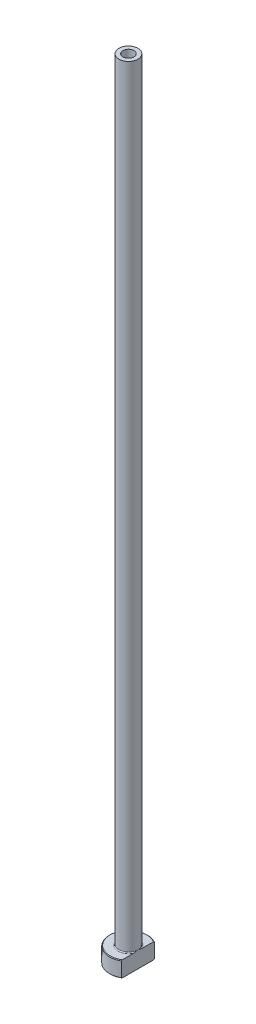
ISO-10303-21;
HEADER;
FILE_DESCRIPTION(('STEP AP214'),'2;1');
FILE_NAME('part.step','',(''),(''),'','','');
FILE_SCHEMA(('AUTOMOTIVE_DESIGN { 1 0 10303 214 1 1 1 1 }'));
ENDSEC;
DATA;
#1=APPLICATION_CONTEXT('core data for automotive mechanical design processes');
#2=APPLICATION_PROTOCOL_DEFINITION('international standard','automotive_design',2000,#1);
#3=PRODUCT_CONTEXT('',#1,'mechanical');
#4=PRODUCT('Part','Part','',(#3));
#5=PRODUCT_RELATED_PRODUCT_CATEGORY('part','',(#4));
#6=PRODUCT_DEFINITION_FORMATION('','',#4);
#7=PRODUCT_DEFINITION_CONTEXT('part definition',#1,'design');
#8=PRODUCT_DEFINITION('design','',#6,#7);
#9=PRODUCT_DEFINITION_SHAPE('','',#8);
#10=(LENGTH_UNIT() NAMED_UNIT(*) SI_UNIT(.MILLI.,.METRE.));
#11=(NAMED_UNIT(*) PLANE_ANGLE_UNIT() SI_UNIT($,.RADIAN.));
#12=(NAMED_UNIT(*) SI_UNIT($,.STERADIAN.) SOLID_ANGLE_UNIT());
#13=UNCERTAINTY_MEASURE_WITH_UNIT(LENGTH_MEASURE(1.E-05),#10,'distance_accuracy_value','');
#14=(GEOMETRIC_REPRESENTATION_CONTEXT(3) GLOBAL_UNCERTAINTY_ASSIGNED_CONTEXT((#13)) GLOBAL_UNIT_ASSIGNED_CONTEXT((#10,
#11,#12)) REPRESENTATION_CONTEXT('',''));
#15=CARTESIAN_POINT('',(0.,0.,0.));
#16=DIRECTION('',(0.,0.,1.));
#17=DIRECTION('',(1.,0.,0.));
#18=AXIS2_PLACEMENT_3D('',#15,#16,#17);
#19=CARTESIAN_POINT('',(0.,92.1876809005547,0.));
#20=DIRECTION('',(0.,1.,0.));
#21=DIRECTION('',(0.,0.,1.));
#22=AXIS2_PLACEMENT_3D('',#19,#20,#21);
#23=CYLINDRICAL_SURFACE('',#22,1.75000000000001);
#24=CARTESIAN_POINT('',(0.,250.,0.));
#25=DIRECTION('',(0.,1.,0.));
#26=DIRECTION('',(0.,0.,1.));
#27=AXIS2_PLACEMENT_3D('',#24,#25,#26);
#28=CIRCLE('',#27,1.75000000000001);
#29=CARTESIAN_POINT('',(0.,250.,1.75000000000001));
#30=VERTEX_POINT('',#29);
#31=EDGE_CURVE('E167',#30,#30,#28,.T.);
#32=ORIENTED_EDGE('',*,*,#31,.T.);
#33=EDGE_LOOP('',(#32));
#34=FACE_BOUND('',#33,.T.);
#35=CARTESIAN_POINT('',(0.,205.,0.));
#36=DIRECTION('',(0.,1.,0.));
#37=DIRECTION('',(0.,0.,1.));
#38=AXIS2_PLACEMENT_3D('',#35,#36,#37);
#39=CIRCLE('',#38,1.75000000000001);
#40=CARTESIAN_POINT('',(0.,205.,1.75000000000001));
#41=VERTEX_POINT('',#40);
#42=EDGE_CURVE('E170',#41,#41,#39,.T.);
#43=ORIENTED_EDGE('',*,*,#42,.F.);
#44=EDGE_LOOP('',(#43));
#45=FACE_BOUND('',#44,.T.);
#46=ADVANCED_FACE('F32',(#34,#45),#23,.F.);
#47=CARTESIAN_POINT('',(-1.75000000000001,250.,0.));
#48=DIRECTION('',(0.,1.,0.));
#49=DIRECTION('',(0.,0.,1.));
#50=AXIS2_PLACEMENT_3D('',#47,#48,#49);
#51=PLANE('',#50);
#52=CARTESIAN_POINT('',(0.,250.,0.));
#53=DIRECTION('',(0.,1.,0.));
#54=DIRECTION('',(0.,0.,1.));
#55=AXIS2_PLACEMENT_3D('',#52,#53,#54);
#56=CIRCLE('',#55,3.00000000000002);
#57=CARTESIAN_POINT('',(0.,250.,3.00000000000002));
#58=VERTEX_POINT('',#57);
#59=EDGE_CURVE('E174',#58,#58,#56,.T.);
#60=ORIENTED_EDGE('',*,*,#59,.T.);
#61=EDGE_LOOP('',(#60));
#62=FACE_BOUND('',#61,.T.);
#63=ORIENTED_EDGE('',*,*,#31,.F.);
#64=EDGE_LOOP('',(#63));
#65=FACE_BOUND('',#64,.T.);
#66=ADVANCED_FACE('F157',(#62,#65),#51,.T.);
#67=CARTESIAN_POINT('',(0.,92.1876809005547,0.));
#68=DIRECTION('',(0.,1.,0.));
#69=DIRECTION('',(0.,0.,1.));
#70=AXIS2_PLACEMENT_3D('',#67,#68,#69);
#71=CYLINDRICAL_SURFACE('',#70,3.);
#72=CARTESIAN_POINT('',(0.,5.3,0.));
#73=DIRECTION('',(0.,1.,0.));
#74=DIRECTION('',(0.,0.,1.));
#75=AXIS2_PLACEMENT_3D('',#72,#73,#74);
#76=CIRCLE('',#75,3.);
#77=CARTESIAN_POINT('',(3.,5.3,0.));
#78=VERTEX_POINT('',#77);
#79=EDGE_CURVE('E180',#78,#78,#76,.T.);
#80=ORIENTED_EDGE('',*,*,#79,.T.);
#81=EDGE_LOOP('',(#80));
#82=FACE_BOUND('',#81,.T.);
#83=ORIENTED_EDGE('',*,*,#59,.F.);
#84=EDGE_LOOP('',(#83));
#85=FACE_BOUND('',#84,.T.);
#86=ADVANCED_FACE('F162',(#82,#85),#71,.T.);
#87=CARTESIAN_POINT('',(-2.99999999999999,5.,0.));
#88=DIRECTION('',(0.,1.,0.));
#89=DIRECTION('',(0.,0.,1.));
#90=AXIS2_PLACEMENT_3D('',#87,#88,#89);
#91=PLANE('',#90);
#92=DIRECTION('',(0.,0.,1.));
#93=VECTOR('',#92,1.);
#94=CARTESIAN_POINT('',(3.,5.,0.));
#95=LINE('',#94,#93);
#96=CARTESIAN_POINT('',(3.,5.,-4.96386945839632));
#97=VERTEX_POINT('',#96);
#98=CARTESIAN_POINT('',(3.,5.,-1.37477270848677));
#99=VERTEX_POINT('',#98);
#100=EDGE_CURVE('E54',#97,#99,#95,.T.);
#101=ORIENTED_EDGE('',*,*,#100,.F.);
#102=CARTESIAN_POINT('',(0.,5.,0.));
#103=DIRECTION('',(0.,1.,0.));
#104=DIRECTION('',(0.,0.,1.));
#105=AXIS2_PLACEMENT_3D('',#102,#103,#104);
#106=CIRCLE('',#105,5.79999999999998);
#107=CARTESIAN_POINT('',(2.99999999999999,5.,4.96386945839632));
#108=VERTEX_POINT('',#107);
#109=EDGE_CURVE('E186',#97,#108,#106,.T.);
#110=ORIENTED_EDGE('',*,*,#109,.T.);
#111=CARTESIAN_POINT('',(3.,5.,1.37477270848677));
#112=VERTEX_POINT('',#111);
#113=EDGE_CURVE('E134',#112,#108,#95,.T.);
#114=ORIENTED_EDGE('',*,*,#113,.F.);
#115=CARTESIAN_POINT('',(0.,5.,0.));
#116=DIRECTION('',(0.,1.,0.));
#117=DIRECTION('',(0.,0.,1.));
#118=AXIS2_PLACEMENT_3D('',#115,#116,#117);
#119=CIRCLE('',#118,3.3);
#120=EDGE_CURVE('E183',#112,#99,#119,.F.);
#121=ORIENTED_EDGE('',*,*,#120,.T.);
#122=EDGE_LOOP('',(#101,#110,#114,#121));
#123=FACE_BOUND('',#122,.T.);
#124=ADVANCED_FACE('F197',(#123),#91,.T.);
#125=CARTESIAN_POINT('',(0.,92.1876809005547,0.));
#126=DIRECTION('',(0.,1.,0.));
#127=DIRECTION('',(0.,0.,1.));
#128=AXIS2_PLACEMENT_3D('',#125,#126,#127);
#129=CYLINDRICAL_SURFACE('',#128,5.99999999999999);
#130=DIRECTION('',(0.,-1.,0.));
#131=VECTOR('',#130,1.);
#132=CARTESIAN_POINT('',(2.99999999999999,250.,5.19615242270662));
#133=LINE('',#132,#131);
#134=CARTESIAN_POINT('',(2.99999999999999,4.79999999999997,5.19615242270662));
#135=VERTEX_POINT('',#134);
#136=CARTESIAN_POINT('',(2.99999999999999,0.199999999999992,5.19615242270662));
#137=VERTEX_POINT('',#136);
#138=EDGE_CURVE('E82',#135,#137,#133,.T.);
#139=ORIENTED_EDGE('',*,*,#138,.F.);
#140=CARTESIAN_POINT('',(0.,4.79999999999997,0.));
#141=DIRECTION('',(0.,1.,0.));
#142=DIRECTION('',(0.,0.,1.));
#143=AXIS2_PLACEMENT_3D('',#140,#141,#142);
#144=CIRCLE('',#143,5.99999999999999);
#145=CARTESIAN_POINT('',(3.,4.79999999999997,-5.19615242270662));
#146=VERTEX_POINT('',#145);
#147=EDGE_CURVE('E95',#135,#146,#144,.F.);
#148=ORIENTED_EDGE('',*,*,#147,.T.);
#149=DIRECTION('',(0.,-1.,0.));
#150=VECTOR('',#149,1.);
#151=CARTESIAN_POINT('',(3.,250.,-5.19615242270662));
#152=LINE('',#151,#150);
#153=CARTESIAN_POINT('',(3.,0.199999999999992,-5.19615242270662));
#154=VERTEX_POINT('',#153);
#155=EDGE_CURVE('E192',#146,#154,#152,.T.);
#156=ORIENTED_EDGE('',*,*,#155,.T.);
#157=CARTESIAN_POINT('',(0.,0.199999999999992,0.));
#158=DIRECTION('',(0.,-1.,0.));
#159=DIRECTION('',(0.,0.,-1.));
#160=AXIS2_PLACEMENT_3D('',#157,#158,#159);
#161=CIRCLE('',#160,5.99999999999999);
#162=EDGE_CURVE('E98',#154,#137,#161,.F.);
#163=ORIENTED_EDGE('',*,*,#162,.T.);
#164=EDGE_LOOP('',(#139,#148,#156,#163));
#165=FACE_BOUND('',#164,.T.);
#166=ADVANCED_FACE('F190',(#165),#129,.T.);
#167=CARTESIAN_POINT('',(-5.99999999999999,0.,0.));
#168=DIRECTION('',(0.,-1.,0.));
#169=DIRECTION('',(0.,0.,-1.));
#170=AXIS2_PLACEMENT_3D('',#167,#168,#169);
#171=PLANE('',#170);
#172=CARTESIAN_POINT('',(0.,0.,0.));
#173=DIRECTION('',(0.,-1.,0.));
#174=DIRECTION('',(0.,0.,-1.));
#175=AXIS2_PLACEMENT_3D('',#172,#173,#174);
#176=CIRCLE('',#175,2.49999999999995);
#177=CARTESIAN_POINT('',(0.,0.,-2.49999999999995));
#178=VERTEX_POINT('',#177);
#179=EDGE_CURVE('E40',#178,#178,#176,.F.);
#180=ORIENTED_EDGE('',*,*,#179,.T.);
#181=EDGE_LOOP('',(#180));
#182=FACE_BOUND('',#181,.T.);
#183=DIRECTION('',(0.,0.,-1.));
#184=VECTOR('',#183,1.);
#185=CARTESIAN_POINT('',(2.99999999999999,0.,5.19615242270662));
#186=LINE('',#185,#184);
#187=CARTESIAN_POINT('',(2.99999999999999,0.,4.96386945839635));
#188=VERTEX_POINT('',#187);
#189=CARTESIAN_POINT('',(3.,0.,-4.96386945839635));
#190=VERTEX_POINT('',#189);
#191=EDGE_CURVE('E47',#188,#190,#186,.T.);
#192=ORIENTED_EDGE('',*,*,#191,.F.);
#193=CARTESIAN_POINT('',(0.,0.,0.));
#194=DIRECTION('',(0.,-1.,0.));
#195=DIRECTION('',(0.,0.,-1.));
#196=AXIS2_PLACEMENT_3D('',#193,#194,#195);
#197=CIRCLE('',#196,5.8);
#198=EDGE_CURVE('E92',#188,#190,#197,.T.);
#199=ORIENTED_EDGE('',*,*,#198,.T.);
#200=EDGE_LOOP('',(#192,#199));
#201=FACE_BOUND('',#200,.T.);
#202=ADVANCED_FACE('F91',(#182,#201),#171,.T.);
#203=CARTESIAN_POINT('',(0.,92.1876809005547,0.));
#204=DIRECTION('',(0.,1.,0.));
#205=DIRECTION('',(0.,0.,1.));
#206=AXIS2_PLACEMENT_3D('',#203,#204,#205);
#207=CYLINDRICAL_SURFACE('',#206,2.);
#208=CARTESIAN_POINT('',(0.,0.499999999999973,0.));
#209=DIRECTION('',(0.,-1.,0.));
#210=DIRECTION('',(0.,0.,-1.));
#211=AXIS2_PLACEMENT_3D('',#208,#209,#210);
#212=CIRCLE('',#211,2.);
#213=CARTESIAN_POINT('',(0.,0.499999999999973,-2.));
#214=VERTEX_POINT('',#213);
#215=EDGE_CURVE('E11',#214,#214,#212,.T.);
#216=ORIENTED_EDGE('',*,*,#215,.T.);
#217=EDGE_LOOP('',(#216));
#218=FACE_BOUND('',#217,.T.);
#219=CARTESIAN_POINT('',(0.,193.,0.));
#220=DIRECTION('',(0.,1.,0.));
#221=DIRECTION('',(0.,0.,1.));
#222=AXIS2_PLACEMENT_3D('',#219,#220,#221);
#223=CIRCLE('',#222,2.00000000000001);
#224=CARTESIAN_POINT('',(0.,193.,2.00000000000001));
#225=VERTEX_POINT('',#224);
#226=EDGE_CURVE('E172',#225,#225,#223,.T.);
#227=ORIENTED_EDGE('',*,*,#226,.T.);
#228=EDGE_LOOP('',(#227));
#229=FACE_BOUND('',#228,.T.);
#230=ADVANCED_FACE('F215',(#218,#229),#207,.F.);
#231=CARTESIAN_POINT('',(0.,193.,0.));
#232=DIRECTION('',(0.,-1.,0.));
#233=DIRECTION('',(0.,0.,-1.));
#234=AXIS2_PLACEMENT_3D('',#231,#232,#233);
#235=CONICAL_SURFACE('',#234,2.00000000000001,0.0208303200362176);
#236=ORIENTED_EDGE('',*,*,#42,.T.);
#237=EDGE_LOOP('',(#236));
#238=FACE_BOUND('',#237,.T.);
#239=ORIENTED_EDGE('',*,*,#226,.F.);
#240=EDGE_LOOP('',(#239));
#241=FACE_BOUND('',#240,.T.);
#242=ADVANCED_FACE('F111',(#238,#241),#235,.F.);
#243=CARTESIAN_POINT('',(0.,5.3,0.));
#244=DIRECTION('',(0.,1.,0.));
#245=DIRECTION('',(0.,0.,1.));
#246=AXIS2_PLACEMENT_3D('',#243,#244,#245);
#247=TOROIDAL_SURFACE('',#246,3.3,0.3);
#248=ORIENTED_EDGE('',*,*,#120,.F.);
#249=CARTESIAN_POINT('',(3.,5.3,0.));
#250=CARTESIAN_POINT('',(3.,5.30000062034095,-1.12611438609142E-10));
#251=CARTESIAN_POINT('',(3.,5.30000124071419,1.79706891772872E-07));
#252=CARTESIAN_POINT('',(3.,5.30000241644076,7.12597750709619E-07));
#253=CARTESIAN_POINT('',(3.,5.30000296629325,1.07470933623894E-06));
#254=CARTESIAN_POINT('',(3.,5.30000408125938,1.93940859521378E-06));
#255=CARTESIAN_POINT('',(3.,5.30000463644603,2.45488657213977E-06));
#256=CARTESIAN_POINT('',(3.,5.30000565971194,3.54465597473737E-06));
#257=CARTESIAN_POINT('',(3.,5.30000612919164,4.11770742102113E-06));
#258=CARTESIAN_POINT('',(3.,5.30000778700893,6.25396556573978E-06));
#259=CARTESIAN_POINT('',(3.,5.30000888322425,7.8907098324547E-06));
#260=CARTESIAN_POINT('',(3.,5.30001076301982,1.11998068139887E-05));
#261=CARTESIAN_POINT('',(3.,5.30001156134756,1.28642126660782E-05));
#262=CARTESIAN_POINT('',(3.,5.30001474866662,1.96537195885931E-05));
#263=CARTESIAN_POINT('',(3.,5.30001702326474,2.48380271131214E-05));
#264=CARTESIAN_POINT('',(3.,5.30002052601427,3.48178520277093E-05));
#265=CARTESIAN_POINT('',(3.,5.30002184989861,3.95800660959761E-05));
#266=CARTESIAN_POINT('',(3.,5.30003122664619,7.41814435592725E-05));
#267=CARTESIAN_POINT('',(3.,5.30003808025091,0.000104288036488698));
#268=CARTESIAN_POINT('',(2.99999999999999,5.30006804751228,0.000222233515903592));
#269=CARTESIAN_POINT('',(2.99999999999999,5.30009687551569,0.000308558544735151));
#270=CARTESIAN_POINT('',(3.,5.30020809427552,0.000648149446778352));
#271=CARTESIAN_POINT('',(3.,5.30028657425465,0.000902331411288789));
#272=CARTESIAN_POINT('',(2.99999999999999,5.30059876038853,0.00190491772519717));
#273=CARTESIAN_POINT('',(2.99999999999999,5.30083723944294,0.00265218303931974));
#274=CARTESIAN_POINT('',(3.,5.30182192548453,0.00574694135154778));
#275=CARTESIAN_POINT('',(3.,5.30256224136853,0.00809584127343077));
#276=CARTESIAN_POINT('',(2.99999999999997,5.31160267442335,0.0367678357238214));
#277=CARTESIAN_POINT('',(2.99999999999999,5.31993817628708,0.0630827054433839));
#278=CARTESIAN_POINT('',(3.,5.33621504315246,0.114704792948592));
#279=CARTESIAN_POINT('',(3.,5.34415908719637,0.140011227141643));
#280=CARTESIAN_POINT('',(2.99999999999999,5.36094382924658,0.193774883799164));
#281=CARTESIAN_POINT('',(2.99999999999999,5.369774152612,0.222235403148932));
#282=CARTESIAN_POINT('',(3.,5.38736474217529,0.279512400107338));
#283=CARTESIAN_POINT('',(2.99999999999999,5.3961232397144,0.308329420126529));
#284=CARTESIAN_POINT('',(2.99999999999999,5.41726575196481,0.37888037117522));
#285=CARTESIAN_POINT('',(2.99999999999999,5.4295272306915,0.420651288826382));
#286=CARTESIAN_POINT('',(2.99999999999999,5.45309597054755,0.503357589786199));
#287=CARTESIAN_POINT('',(2.99999999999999,5.46441924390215,0.544288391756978));
#288=CARTESIAN_POINT('',(2.99999999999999,5.487781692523,0.632156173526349));
#289=CARTESIAN_POINT('',(2.99999999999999,5.49969678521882,0.679126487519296));
#290=CARTESIAN_POINT('',(2.99999999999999,5.52221484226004,0.7737409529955));
#291=CARTESIAN_POINT('',(2.99999999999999,5.53280772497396,0.821387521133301));
#292=CARTESIAN_POINT('',(2.99999999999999,5.55291503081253,0.920589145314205));
#293=CARTESIAN_POINT('',(2.99999999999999,5.56229188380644,0.972172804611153));
#294=CARTESIAN_POINT('',(2.99999999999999,5.57838694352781,1.07574836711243));
#295=CARTESIAN_POINT('',(2.99999999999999,5.58510535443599,1.12774023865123));
#296=CARTESIAN_POINT('',(2.99999999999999,5.59681427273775,1.24924411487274));
#297=CARTESIAN_POINT('',(2.99999999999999,5.60051317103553,1.31890364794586));
#298=CARTESIAN_POINT('',(2.99999999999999,5.59966579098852,1.42270835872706));
#299=CARTESIAN_POINT('',(2.99999999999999,5.598358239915,1.45688093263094));
#300=CARTESIAN_POINT('',(2.99999999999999,5.59322745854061,1.52502533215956));
#301=CARTESIAN_POINT('',(2.99999999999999,5.58940645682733,1.55899730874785));
#302=CARTESIAN_POINT('',(2.99999999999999,5.57976146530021,1.61947815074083));
#303=CARTESIAN_POINT('',(2.99999999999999,5.57451506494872,1.64607760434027));
#304=CARTESIAN_POINT('',(2.99999999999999,5.56161153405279,1.6988364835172));
#305=CARTESIAN_POINT('',(2.99999999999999,5.55394338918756,1.72499331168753));
#306=CARTESIAN_POINT('',(2.99999999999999,5.53555176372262,1.77650913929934));
#307=CARTESIAN_POINT('',(2.99999999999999,5.52480031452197,1.80185836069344));
#308=CARTESIAN_POINT('',(2.99999999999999,5.49948027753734,1.85054545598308));
#309=CARTESIAN_POINT('',(2.99999999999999,5.4849314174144,1.87389291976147));
#310=CARTESIAN_POINT('',(2.99999999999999,5.45992470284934,1.90552135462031));
#311=CARTESIAN_POINT('',(2.99999999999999,5.45133318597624,1.91527363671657));
#312=CARTESIAN_POINT('',(2.99999999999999,5.43294163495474,1.93360072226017));
#313=CARTESIAN_POINT('',(2.99999999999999,5.42314083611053,1.94217477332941));
#314=CARTESIAN_POINT('',(2.99999999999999,5.40215892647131,1.95778354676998));
#315=CARTESIAN_POINT('',(2.99999999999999,5.39096156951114,1.96479687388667));
#316=CARTESIAN_POINT('',(2.99999999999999,5.36742144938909,1.97652218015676));
#317=CARTESIAN_POINT('',(2.99999999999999,5.35508207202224,1.98124071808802));
#318=CARTESIAN_POINT('',(2.99999999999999,5.33320117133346,1.98690185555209));
#319=CARTESIAN_POINT('',(2.99999999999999,5.3238355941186,1.98852953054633));
#320=CARTESIAN_POINT('',(2.99999999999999,5.30496375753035,1.99016898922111));
#321=CARTESIAN_POINT('',(2.99999999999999,5.29545756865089,1.99018155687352));
#322=CARTESIAN_POINT('',(2.99999999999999,5.27659318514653,1.98858978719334));
#323=CARTESIAN_POINT('',(2.99999999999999,5.26723486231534,1.98698693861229));
#324=CARTESIAN_POINT('',(2.99999999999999,5.2488995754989,1.98229727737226));
#325=CARTESIAN_POINT('',(2.99999999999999,5.23992286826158,1.9792094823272));
#326=CARTESIAN_POINT('',(2.99999999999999,5.21981293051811,1.97059641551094));
#327=CARTESIAN_POINT('',(2.99999999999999,5.20887713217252,1.96461176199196));
#328=CARTESIAN_POINT('',(2.99999999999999,5.18811536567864,1.95095727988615));
#329=CARTESIAN_POINT('',(2.99999999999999,5.17829177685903,1.94328393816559));
#330=CARTESIAN_POINT('',(2.99999999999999,5.15512177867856,1.92254223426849));
#331=CARTESIAN_POINT('',(2.99999999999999,5.14247568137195,1.90869680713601));
#332=CARTESIAN_POINT('',(2.99999999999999,5.11944595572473,1.87927587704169));
#333=CARTESIAN_POINT('',(2.99999999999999,5.10906527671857,1.86369815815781));
#334=CARTESIAN_POINT('',(2.99999999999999,5.08309609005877,1.81927355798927));
#335=CARTESIAN_POINT('',(2.99999999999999,5.06948546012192,1.78928084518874));
#336=CARTESIAN_POINT('',(2.99999999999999,5.04658664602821,1.72751962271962));
#337=CARTESIAN_POINT('',(2.99999999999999,5.03733582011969,1.69573828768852));
#338=CARTESIAN_POINT('',(2.99999999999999,5.02214318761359,1.63079918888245));
#339=CARTESIAN_POINT('',(2.99999999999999,5.01626537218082,1.59762686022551));
#340=CARTESIAN_POINT('',(2.99999999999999,5.00734002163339,1.53086029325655));
#341=CARTESIAN_POINT('',(2.99999999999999,5.00429797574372,1.49726536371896));
#342=CARTESIAN_POINT('',(2.99999999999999,5.00059037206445,1.43100872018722));
#343=CARTESIAN_POINT('',(2.99999999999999,4.9998534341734,1.39835069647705));
#344=CARTESIAN_POINT('',(2.99999999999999,5.00019322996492,1.33318312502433));
#345=CARTESIAN_POINT('',(2.99999999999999,5.00126261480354,1.30067351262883));
#346=CARTESIAN_POINT('',(2.99999999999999,5.00569854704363,1.22190465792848));
#347=CARTESIAN_POINT('',(2.99999999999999,5.00984986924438,1.17569031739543));
#348=CARTESIAN_POINT('',(2.99999999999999,5.020608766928,1.08357061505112));
#349=CARTESIAN_POINT('',(2.99999999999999,5.02721586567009,1.03766519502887));
#350=CARTESIAN_POINT('',(2.99999999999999,5.0425809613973,0.945130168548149));
#351=CARTESIAN_POINT('',(2.99999999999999,5.0513851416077,0.898508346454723));
#352=CARTESIAN_POINT('',(2.99999999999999,5.07066869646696,0.805496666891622));
#353=CARTESIAN_POINT('',(2.99999999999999,5.08115218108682,0.759107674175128));
#354=CARTESIAN_POINT('',(2.99999999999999,5.10738921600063,0.650207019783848));
#355=CARTESIAN_POINT('',(2.99999999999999,5.12369110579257,0.587828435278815));
#356=CARTESIAN_POINT('',(3.,5.15777680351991,0.464212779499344));
#357=CARTESIAN_POINT('',(3.,5.17554263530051,0.402970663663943));
#358=CARTESIAN_POINT('',(2.99999999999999,5.21006724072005,0.287596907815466));
#359=CARTESIAN_POINT('',(2.99999999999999,5.2267179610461,0.233432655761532));
#360=CARTESIAN_POINT('',(3.,5.25241226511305,0.150940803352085));
#361=CARTESIAN_POINT('',(3.00000000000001,5.2613106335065,0.122567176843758));
#362=CARTESIAN_POINT('',(2.99999999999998,5.27905176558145,0.0662804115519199));
#363=CARTESIAN_POINT('',(2.99999999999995,5.28789327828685,0.0383669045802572));
#364=CARTESIAN_POINT('',(3.,5.29743877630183,0.00809257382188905));
#365=CARTESIAN_POINT('',(3.,5.29818012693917,0.00574041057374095));
#366=CARTESIAN_POINT('',(2.99999999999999,5.29916506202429,0.0026448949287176));
#367=CARTESIAN_POINT('',(2.99999999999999,5.29940274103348,0.00190013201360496));
#368=CARTESIAN_POINT('',(3.,5.29971394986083,0.000900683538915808));
#369=CARTESIAN_POINT('',(3.,5.2997922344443,0.000647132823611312));
#370=CARTESIAN_POINT('',(2.99999999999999,5.29990321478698,0.000308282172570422));
#371=CARTESIAN_POINT('',(2.99999999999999,5.2999320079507,0.00022206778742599));
#372=CARTESIAN_POINT('',(3.,5.29996194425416,0.000104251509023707));
#373=CARTESIAN_POINT('',(3.,5.29996879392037,7.41614273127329E-05));
#374=CARTESIAN_POINT('',(3.,5.29997816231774,3.95766724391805E-05));
#375=CARTESIAN_POINT('',(3.,5.29997948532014,3.48154685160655E-05));
#376=CARTESIAN_POINT('',(3.,5.29998298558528,2.48376295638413E-05));
#377=CARTESIAN_POINT('',(3.,5.29998525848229,1.96542464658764E-05));
#378=CARTESIAN_POINT('',(3.,5.29998844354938,1.28656661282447E-05));
#379=CARTESIAN_POINT('',(3.,5.29998924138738,1.12013356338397E-05));
#380=CARTESIAN_POINT('',(3.,5.29999112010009,7.892300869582E-06));
#381=CARTESIAN_POINT('',(3.,5.29999221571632,6.25553580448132E-06));
#382=CARTESIAN_POINT('',(3.,5.29999387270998,4.1191439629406E-06));
#383=CARTESIAN_POINT('',(3.,5.29999434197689,3.5460312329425E-06));
#384=CARTESIAN_POINT('',(3.,5.29999536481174,2.45610093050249E-06));
#385=CARTESIAN_POINT('',(3.,5.29999591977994,1.94052248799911E-06));
#386=CARTESIAN_POINT('',(3.,5.29999703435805,1.07558337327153E-06));
#387=CARTESIAN_POINT('',(3.,5.29999758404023,7.13339557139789E-07));
#388=CARTESIAN_POINT('',(3.,5.29999875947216,1.80121987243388E-07));
#389=CARTESIAN_POINT('',(3.,5.29999937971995,1.12600883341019E-10));
#390=CARTESIAN_POINT('',(3.,5.3,0.));
#391=B_SPLINE_CURVE_WITH_KNOTS('',3,(#249,#250,#251,#252,#253,#254,#255,#256,#257,#258,#259,
#260,#261,#262,#263,#264,#265,#266,#267,#268,#269,#270,#271,#272,#273,#274,#275,#276,#277,#278,
#279,#280,#281,#282,#283,#284,#285,#286,#287,#288,#289,#290,#291,#292,#293,#294,#295,#296,#297,
#298,#299,#300,#301,#302,#303,#304,#305,#306,#307,#308,#309,#310,#311,#312,#313,#314,#315,#316,
#317,#318,#319,#320,#321,#322,#323,#324,#325,#326,#327,#328,#329,#330,#331,#332,#333,#334,#335,
#336,#337,#338,#339,#340,#341,#342,#343,#344,#345,#346,#347,#348,#349,#350,#351,#352,#353,#354,
#355,#356,#357,#358,#359,#360,#361,#362,#363,#364,#365,#366,#367,#368,#369,#370,#371,#372,#373,
#374,#375,#376,#377,#378,#379,#380,#381,#382,#383,#384,#385,#386,#387,#388,#389,#390),
.UNSPECIFIED.,.T.,.F.,(4,2,2,2,2,2,2,2,2,2,2,2,2,2,2,2,2,2,2,2,2,2,2,2,2,2,2,2,2,2,2,2,2,2,2,2,
2,2,2,2,2,2,2,2,2,2,2,2,2,2,2,2,2,2,2,2,2,2,2,2,2,2,2,2,2,2,2,2,2,2,4),(0.,1.86513770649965E-06,
3.83353071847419E-06,6.09513005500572E-06,8.31560246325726E-06,1.42000663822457E-05,
1.9733545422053E-05,3.66769819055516E-05,5.14858258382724E-05,0.000144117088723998,
0.000416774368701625,0.00121521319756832,0.00356794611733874,0.0109568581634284,
0.0937636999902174,0.173336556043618,0.262732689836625,0.353088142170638,0.483684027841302,
0.611082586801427,0.756439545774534,0.902844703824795,1.06007042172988,1.21728406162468,
1.42611662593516,1.52864191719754,1.63107642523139,1.71232857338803,1.79395571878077,
1.87634808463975,1.95832065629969,1.99722769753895,2.03615946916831,2.07559591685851,
2.11491897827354,2.14330913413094,2.17168550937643,2.20003575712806,2.22840478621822,
2.2655955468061,2.3028644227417,2.35880214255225,2.41481225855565,2.51307007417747,
2.61215518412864,2.71306273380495,2.81416520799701,2.91210427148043,3.00964583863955,
3.14875779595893,3.2878427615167,3.43014232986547,3.5727956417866,3.76617940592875,
3.95746724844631,4.12746077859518,4.21667041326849,4.30450746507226,4.31190664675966,
4.31425150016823,4.31504795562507,4.31532026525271,4.31541284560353,4.31542765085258,
4.31544458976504,4.31545012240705,4.31545600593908,4.31545822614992,4.31546048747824,
4.31546245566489,4.31546432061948),.UNSPECIFIED.);
#392=EDGE_CURVE('E126',#112,#78,#391,.T.);
#393=ORIENTED_EDGE('',*,*,#392,.T.);
#394=ORIENTED_EDGE('',*,*,#79,.F.);
#395=CARTESIAN_POINT('',(3.,5.3,0.));
#396=CARTESIAN_POINT('',(3.,5.29999937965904,1.12612008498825E-10));
#397=CARTESIAN_POINT('',(3.,5.29999875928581,-1.79706891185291E-07));
#398=CARTESIAN_POINT('',(3.,5.29999758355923,-7.12597750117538E-07));
#399=CARTESIAN_POINT('',(3.,5.29999703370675,-1.07470933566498E-06));
#400=CARTESIAN_POINT('',(3.,5.29999591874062,-1.93940859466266E-06));
#401=CARTESIAN_POINT('',(3.,5.29999536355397,-2.45488657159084E-06));
#402=CARTESIAN_POINT('',(3.,5.29999434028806,-3.54465597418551E-06));
#403=CARTESIAN_POINT('',(3.,5.29999387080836,-4.11770742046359E-06));
#404=CARTESIAN_POINT('',(3.,5.29999221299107,-6.25396556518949E-06));
#405=CARTESIAN_POINT('',(3.,5.29999111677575,-7.89070983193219E-06));
#406=CARTESIAN_POINT('',(3.,5.29998923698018,-1.11998068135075E-05));
#407=CARTESIAN_POINT('',(3.,5.29998843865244,-1.2864212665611E-05));
#408=CARTESIAN_POINT('',(3.,5.29998525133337,-1.9653719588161E-05));
#409=CARTESIAN_POINT('',(3.,5.29998297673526,-2.48380271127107E-05));
#410=CARTESIAN_POINT('',(3.,5.29997947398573,-3.48178520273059E-05));
#411=CARTESIAN_POINT('',(3.,5.29997815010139,-3.9580066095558E-05));
#412=CARTESIAN_POINT('',(3.,5.29996877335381,-7.41814435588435E-05));
#413=CARTESIAN_POINT('',(3.,5.29996191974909,-0.000104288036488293));
#414=CARTESIAN_POINT('',(2.99999999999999,5.29993195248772,-0.000222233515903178));
#415=CARTESIAN_POINT('',(2.99999999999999,5.29990312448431,-0.000308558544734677));
#416=CARTESIAN_POINT('',(3.,5.29979190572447,-0.000648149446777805));
#417=CARTESIAN_POINT('',(3.,5.29971342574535,-0.000902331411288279));
#418=CARTESIAN_POINT('',(2.99999999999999,5.29940123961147,-0.00190491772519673));
#419=CARTESIAN_POINT('',(2.99999999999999,5.29916276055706,-0.00265218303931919));
#420=CARTESIAN_POINT('',(3.,5.29817807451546,-0.00574694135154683));
#421=CARTESIAN_POINT('',(3.,5.29743775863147,-0.00809584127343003));
#422=CARTESIAN_POINT('',(2.99999999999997,5.28839732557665,-0.0367678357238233));
#423=CARTESIAN_POINT('',(2.99999999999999,5.28006182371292,-0.0630827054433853));
#424=CARTESIAN_POINT('',(3.,5.26378495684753,-0.114704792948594));
#425=CARTESIAN_POINT('',(3.,5.25584091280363,-0.140011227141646));
#426=CARTESIAN_POINT('',(2.99999999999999,5.23905617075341,-0.193774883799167));
#427=CARTESIAN_POINT('',(2.99999999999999,5.230225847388,-0.222235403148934));
#428=CARTESIAN_POINT('',(3.,5.21263525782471,-0.279512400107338));
#429=CARTESIAN_POINT('',(2.99999999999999,5.2038767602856,-0.308329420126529));
#430=CARTESIAN_POINT('',(2.99999999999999,5.18273424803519,-0.378880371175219));
#431=CARTESIAN_POINT('',(2.99999999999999,5.1704727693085,-0.42065128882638));
#432=CARTESIAN_POINT('',(2.99999999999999,5.14690402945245,-0.503357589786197));
#433=CARTESIAN_POINT('',(2.99999999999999,5.13558075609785,-0.544288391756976));
#434=CARTESIAN_POINT('',(2.99999999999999,5.112218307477,-0.632156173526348));
#435=CARTESIAN_POINT('',(2.99999999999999,5.10030321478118,-0.679126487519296));
#436=CARTESIAN_POINT('',(2.99999999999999,5.07778515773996,-0.7737409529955));
#437=CARTESIAN_POINT('',(2.99999999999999,5.06719227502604,-0.821387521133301));
#438=CARTESIAN_POINT('',(2.99999999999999,5.04708496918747,-0.920589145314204));
#439=CARTESIAN_POINT('',(2.99999999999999,5.03770811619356,-0.972172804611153));
#440=CARTESIAN_POINT('',(2.99999999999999,5.02161305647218,-1.07574836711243));
#441=CARTESIAN_POINT('',(2.99999999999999,5.01489464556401,-1.12774023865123));
#442=CARTESIAN_POINT('',(2.99999999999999,5.00318572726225,-1.24924411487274));
#443=CARTESIAN_POINT('',(2.99999999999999,4.99948682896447,-1.31890364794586));
#444=CARTESIAN_POINT('',(2.99999999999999,5.00033420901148,-1.42270835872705));
#445=CARTESIAN_POINT('',(2.99999999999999,5.001641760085,-1.45688093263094));
#446=CARTESIAN_POINT('',(2.99999999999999,5.00677254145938,-1.52502533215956));
#447=CARTESIAN_POINT('',(2.99999999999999,5.01059354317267,-1.55899730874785));
#448=CARTESIAN_POINT('',(2.99999999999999,5.02023853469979,-1.61947815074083));
#449=CARTESIAN_POINT('',(2.99999999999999,5.02548493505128,-1.64607760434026));
#450=CARTESIAN_POINT('',(2.99999999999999,5.03838846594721,-1.6988364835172));
#451=CARTESIAN_POINT('',(2.99999999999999,5.04605661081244,-1.72499331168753));
#452=CARTESIAN_POINT('',(2.99999999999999,5.06444823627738,-1.77650913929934));
#453=CARTESIAN_POINT('',(2.99999999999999,5.07519968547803,-1.80185836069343));
#454=CARTESIAN_POINT('',(2.99999999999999,5.10051972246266,-1.85054545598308));
#455=CARTESIAN_POINT('',(2.99999999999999,5.1150685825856,-1.87389291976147));
#456=CARTESIAN_POINT('',(2.99999999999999,5.14007529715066,-1.90552135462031));
#457=CARTESIAN_POINT('',(2.99999999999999,5.14866681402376,-1.91527363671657));
#458=CARTESIAN_POINT('',(2.99999999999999,5.16705836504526,-1.93360072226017));
#459=CARTESIAN_POINT('',(2.99999999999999,5.17685916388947,-1.94217477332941));
#460=CARTESIAN_POINT('',(2.99999999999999,5.19784107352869,-1.95778354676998));
#461=CARTESIAN_POINT('',(2.99999999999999,5.20903843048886,-1.96479687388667));
#462=CARTESIAN_POINT('',(2.99999999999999,5.23257855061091,-1.97652218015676));
#463=CARTESIAN_POINT('',(2.99999999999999,5.24491792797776,-1.98124071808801));
#464=CARTESIAN_POINT('',(2.99999999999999,5.26679882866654,-1.98690185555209));
#465=CARTESIAN_POINT('',(2.99999999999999,5.27616440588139,-1.98852953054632));
#466=CARTESIAN_POINT('',(2.99999999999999,5.29503624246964,-1.99016898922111));
#467=CARTESIAN_POINT('',(2.99999999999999,5.30454243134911,-1.99018155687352));
#468=CARTESIAN_POINT('',(2.99999999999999,5.32340681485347,-1.98858978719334));
#469=CARTESIAN_POINT('',(2.99999999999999,5.33276513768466,-1.98698693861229));
#470=CARTESIAN_POINT('',(2.99999999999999,5.3511004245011,-1.98229727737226));
#471=CARTESIAN_POINT('',(2.99999999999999,5.36007713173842,-1.9792094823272));
#472=CARTESIAN_POINT('',(2.99999999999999,5.38018706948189,-1.97059641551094));
#473=CARTESIAN_POINT('',(2.99999999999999,5.39112286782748,-1.96461176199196));
#474=CARTESIAN_POINT('',(2.99999999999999,5.41188463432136,-1.95095727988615));
#475=CARTESIAN_POINT('',(2.99999999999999,5.42170822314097,-1.94328393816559));
#476=CARTESIAN_POINT('',(2.99999999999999,5.44487822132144,-1.92254223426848));
#477=CARTESIAN_POINT('',(2.99999999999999,5.45752431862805,-1.90869680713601));
#478=CARTESIAN_POINT('',(2.99999999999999,5.48055404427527,-1.87927587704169));
#479=CARTESIAN_POINT('',(2.99999999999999,5.49093472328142,-1.86369815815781));
#480=CARTESIAN_POINT('',(2.99999999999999,5.51690390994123,-1.81927355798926));
#481=CARTESIAN_POINT('',(2.99999999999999,5.53051453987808,-1.78928084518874));
#482=CARTESIAN_POINT('',(2.99999999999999,5.55341335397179,-1.72751962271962));
#483=CARTESIAN_POINT('',(2.99999999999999,5.56266417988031,-1.69573828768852));
#484=CARTESIAN_POINT('',(2.99999999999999,5.57785681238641,-1.63079918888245));
#485=CARTESIAN_POINT('',(2.99999999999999,5.58373462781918,-1.59762686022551));
#486=CARTESIAN_POINT('',(2.99999999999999,5.59265997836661,-1.53086029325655));
#487=CARTESIAN_POINT('',(2.99999999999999,5.59570202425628,-1.49726536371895));
#488=CARTESIAN_POINT('',(2.99999999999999,5.59940962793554,-1.43100872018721));
#489=CARTESIAN_POINT('',(2.99999999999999,5.6001465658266,-1.39835069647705));
#490=CARTESIAN_POINT('',(2.99999999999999,5.59980677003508,-1.33318312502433));
#491=CARTESIAN_POINT('',(2.99999999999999,5.59873738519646,-1.30067351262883));
#492=CARTESIAN_POINT('',(2.99999999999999,5.59430145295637,-1.22190465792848));
#493=CARTESIAN_POINT('',(2.99999999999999,5.59015013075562,-1.17569031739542));
#494=CARTESIAN_POINT('',(2.99999999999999,5.579391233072,-1.08357061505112));
#495=CARTESIAN_POINT('',(2.99999999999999,5.5727841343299,-1.03766519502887));
#496=CARTESIAN_POINT('',(2.99999999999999,5.5574190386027,-0.945130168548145));
#497=CARTESIAN_POINT('',(2.99999999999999,5.5486148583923,-0.89850834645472));
#498=CARTESIAN_POINT('',(2.99999999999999,5.52933130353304,-0.805496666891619));
#499=CARTESIAN_POINT('',(2.99999999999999,5.51884781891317,-0.759107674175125));
#500=CARTESIAN_POINT('',(2.99999999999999,5.49261078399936,-0.650207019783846));
#501=CARTESIAN_POINT('',(2.99999999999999,5.47630889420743,-0.587828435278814));
#502=CARTESIAN_POINT('',(3.,5.44222319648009,-0.464212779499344));
#503=CARTESIAN_POINT('',(3.,5.4244573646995,-0.402970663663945));
#504=CARTESIAN_POINT('',(2.99999999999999,5.38993275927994,-0.28759690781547));
#505=CARTESIAN_POINT('',(2.99999999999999,5.37328203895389,-0.233432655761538));
#506=CARTESIAN_POINT('',(3.,5.34758773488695,-0.150940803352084));
#507=CARTESIAN_POINT('',(3.,5.33868936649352,-0.122567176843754));
#508=CARTESIAN_POINT('',(2.99999999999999,5.32094823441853,-0.0662804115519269));
#509=CARTESIAN_POINT('',(2.99999999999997,5.31210672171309,-0.0383669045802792));
#510=CARTESIAN_POINT('',(3.,5.30256122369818,-0.00809257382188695));
#511=CARTESIAN_POINT('',(3.,5.30181987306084,-0.00574041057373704));
#512=CARTESIAN_POINT('',(2.99999999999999,5.30083493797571,-0.00264489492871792));
#513=CARTESIAN_POINT('',(2.99999999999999,5.30059725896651,-0.00190013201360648));
#514=CARTESIAN_POINT('',(3.,5.30028605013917,-0.000900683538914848));
#515=CARTESIAN_POINT('',(3.,5.30020776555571,-0.000647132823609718));
#516=CARTESIAN_POINT('',(2.99999999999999,5.30009678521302,-0.000308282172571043));
#517=CARTESIAN_POINT('',(2.99999999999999,5.30006799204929,-0.000222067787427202));
#518=CARTESIAN_POINT('',(3.,5.30003805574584,-0.000104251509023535));
#519=CARTESIAN_POINT('',(3.,5.30003120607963,-7.41614273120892E-05));
#520=CARTESIAN_POINT('',(3.,5.30002183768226,-3.95766724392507E-05));
#521=CARTESIAN_POINT('',(3.,5.30002051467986,-3.48154685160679E-05));
#522=CARTESIAN_POINT('',(3.,5.30001701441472,-2.48376295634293E-05));
#523=CARTESIAN_POINT('',(3.,5.3000147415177,-1.96542464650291E-05));
#524=CARTESIAN_POINT('',(3.,5.30001155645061,-1.28656661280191E-05));
#525=CARTESIAN_POINT('',(3.,5.30001075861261,-1.12013356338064E-05));
#526=CARTESIAN_POINT('',(3.,5.30000887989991,-7.89230086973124E-06));
#527=CARTESIAN_POINT('',(3.,5.30000778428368,-6.25553580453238E-06));
#528=CARTESIAN_POINT('',(3.,5.30000612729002,-4.11914396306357E-06));
#529=CARTESIAN_POINT('',(3.,5.3000056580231,-3.54603123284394E-06));
#530=CARTESIAN_POINT('',(3.,5.30000463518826,-2.45610093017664E-06));
#531=CARTESIAN_POINT('',(3.,5.30000408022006,-1.94052248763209E-06));
#532=CARTESIAN_POINT('',(3.,5.30000296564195,-1.07558337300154E-06));
#533=CARTESIAN_POINT('',(3.,5.30000241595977,-7.13339556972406E-07));
#534=CARTESIAN_POINT('',(3.,5.30000124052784,-1.80121986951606E-07));
#535=CARTESIAN_POINT('',(3.,5.30000062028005,-1.12600451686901E-10));
#536=CARTESIAN_POINT('',(3.,5.3,0.));
#537=B_SPLINE_CURVE_WITH_KNOTS('',3,(#395,#396,#397,#398,#399,#400,#401,#402,#403,#404,#405,
#406,#407,#408,#409,#410,#411,#412,#413,#414,#415,#416,#417,#418,#419,#420,#421,#422,#423,#424,
#425,#426,#427,#428,#429,#430,#431,#432,#433,#434,#435,#436,#437,#438,#439,#440,#441,#442,#443,
#444,#445,#446,#447,#448,#449,#450,#451,#452,#453,#454,#455,#456,#457,#458,#459,#460,#461,#462,
#463,#464,#465,#466,#467,#468,#469,#470,#471,#472,#473,#474,#475,#476,#477,#478,#479,#480,#481,
#482,#483,#484,#485,#486,#487,#488,#489,#490,#491,#492,#493,#494,#495,#496,#497,#498,#499,#500,
#501,#502,#503,#504,#505,#506,#507,#508,#509,#510,#511,#512,#513,#514,#515,#516,#517,#518,#519,
#520,#521,#522,#523,#524,#525,#526,#527,#528,#529,#530,#531,#532,#533,#534,#535,#536),
.UNSPECIFIED.,.T.,.F.,(4,2,2,2,2,2,2,2,2,2,2,2,2,2,2,2,2,2,2,2,2,2,2,2,2,2,2,2,2,2,2,2,2,2,2,2,
2,2,2,2,2,2,2,2,2,2,2,2,2,2,2,2,2,2,2,2,2,2,2,2,2,2,2,2,2,2,2,2,2,2,4),(0.,1.86513770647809E-06,
3.83353071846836E-06,6.09513005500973E-06,8.31560246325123E-06,1.42000663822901E-05,
1.97335454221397E-05,3.66769819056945E-05,5.14858258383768E-05,0.000144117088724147,
0.000416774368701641,0.00121521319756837,0.00356794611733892,0.0109568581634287,
0.0937636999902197,0.173336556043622,0.262732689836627,0.353088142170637,0.4836840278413,
0.611082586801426,0.756439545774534,0.902844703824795,1.06007042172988,1.21728406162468,
1.42611662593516,1.52864191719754,1.63107642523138,1.71232857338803,1.79395571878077,
1.87634808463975,1.95832065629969,1.99722769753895,2.03615946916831,2.07559591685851,
2.11491897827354,2.14330913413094,2.17168550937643,2.20003575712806,2.22840478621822,
2.2655955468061,2.3028644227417,2.35880214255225,2.41481225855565,2.51307007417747,
2.61215518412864,2.71306273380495,2.81416520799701,2.91210427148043,3.00964583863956,
3.14875779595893,3.2878427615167,3.43014232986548,3.5727956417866,3.76617940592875,
3.95746724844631,4.12746077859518,4.21667041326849,4.30450746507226,4.31190664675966,
4.31425150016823,4.31504795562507,4.31532026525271,4.31541284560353,4.31542765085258,
4.31544458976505,4.31545012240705,4.31545600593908,4.31545822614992,4.31546048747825,
4.31546245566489,4.31546432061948),.UNSPECIFIED.);
#538=EDGE_CURVE('E135',#78,#99,#537,.T.);
#539=ORIENTED_EDGE('',*,*,#538,.T.);
#540=EDGE_LOOP('',(#248,#393,#394,#539));
#541=FACE_BOUND('',#540,.T.);
#542=ADVANCED_FACE('F141',(#541),#247,.F.);
#543=CARTESIAN_POINT('',(0.,5.,0.));
#544=DIRECTION('',(0.,-1.,0.));
#545=DIRECTION('',(0.,0.,-1.));
#546=AXIS2_PLACEMENT_3D('',#543,#544,#545);
#547=CONICAL_SURFACE('',#546,5.79999999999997,0.785398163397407);
#548=CARTESIAN_POINT('',(3.,-1.01993959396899,-11.432889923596));
#549=CARTESIAN_POINT('',(3.,-0.769424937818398,-11.1738796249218));
#550=CARTESIAN_POINT('',(3.,-0.519179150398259,-10.9146084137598));
#551=CARTESIAN_POINT('',(3.,-0.0193842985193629,-10.395389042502));
#552=CARTESIAN_POINT('',(3.,0.230164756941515,-10.1354408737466));
#553=CARTESIAN_POINT('',(3.,0.728528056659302,-9.61458602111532));
#554=CARTESIAN_POINT('',(3.,0.977341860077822,-9.35367891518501));
#555=CARTESIAN_POINT('',(3.,1.47386965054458,-8.83082274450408));
#556=CARTESIAN_POINT('',(3.,1.72158364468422,-8.56887368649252));
#557=CARTESIAN_POINT('',(3.,2.21069282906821,-8.04884148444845));
#558=CARTESIAN_POINT('',(3.,2.45211594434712,-7.79078462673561));
#559=CARTESIAN_POINT('',(3.,2.93315589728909,-7.27299342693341));
#560=CARTESIAN_POINT('',(3.,3.17277274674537,-7.01325909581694));
#561=CARTESIAN_POINT('',(3.,3.6495002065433,-6.49159990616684));
#562=CARTESIAN_POINT('',(3.,3.88661134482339,-6.22967553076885));
#563=CARTESIAN_POINT('',(3.,4.35738571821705,-5.70275148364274));
#564=CARTESIAN_POINT('',(3.,4.59104909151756,-5.43775193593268));
#565=CARTESIAN_POINT('',(3.,4.96416348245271,-5.00636825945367));
#566=CARTESIAN_POINT('',(3.,5.10520133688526,-4.84135845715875));
#567=CARTESIAN_POINT('',(3.,5.38476673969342,-4.50919282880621));
#568=CARTESIAN_POINT('',(3.,5.5232940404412,-4.34203679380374));
#569=CARTESIAN_POINT('',(3.,5.79842961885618,-4.00319933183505));
#570=CARTESIAN_POINT('',(3.,5.935002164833,-3.83148875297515));
#571=CARTESIAN_POINT('',(3.,6.20336281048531,-3.4844211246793));
#572=CARTESIAN_POINT('',(3.,6.33515205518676,-3.30906496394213));
#573=CARTESIAN_POINT('',(3.,6.59393382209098,-2.95070802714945));
#574=CARTESIAN_POINT('',(2.99999999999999,6.72082315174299,-2.76763161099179));
#575=CARTESIAN_POINT('',(2.99999999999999,6.90336321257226,-2.48771743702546));
#576=CARTESIAN_POINT('',(2.99999999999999,6.96295431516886,-2.3934539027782));
#577=CARTESIAN_POINT('',(2.99999999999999,7.07882720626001,-2.20292146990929));
#578=CARTESIAN_POINT('',(2.99999999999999,7.13510937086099,-2.10665280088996));
#579=CARTESIAN_POINT('',(2.99999999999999,7.24288059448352,-1.91297779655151));
#580=CARTESIAN_POINT('',(2.99999999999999,7.29441986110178,-1.8155997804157));
#581=CARTESIAN_POINT('',(2.99999999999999,7.39241237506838,-1.61833215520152));
#582=CARTESIAN_POINT('',(2.99999999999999,7.43886469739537,-1.51844209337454));
#583=CARTESIAN_POINT('',(2.99999999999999,7.5684003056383,-1.21511948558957));
#584=CARTESIAN_POINT('',(2.99999999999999,7.6420901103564,-1.00730397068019));
#585=CARTESIAN_POINT('',(2.99999999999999,7.72186700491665,-0.695731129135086));
#586=CARTESIAN_POINT('',(2.99999999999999,7.74302901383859,-0.595791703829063));
#587=CARTESIAN_POINT('',(2.99999999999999,7.77582528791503,-0.394325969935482));
#588=CARTESIAN_POINT('',(2.99999999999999,7.78746040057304,-0.292799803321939));
#589=CARTESIAN_POINT('',(2.99999999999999,7.80037895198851,-0.0893987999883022));
#590=CARTESIAN_POINT('',(2.99999999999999,7.80169449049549,0.0124739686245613));
#591=CARTESIAN_POINT('',(2.99999999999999,7.79396363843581,0.215826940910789));
#592=CARTESIAN_POINT('',(2.99999999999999,7.78491639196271,0.317307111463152));
#593=CARTESIAN_POINT('',(2.99999999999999,7.75721241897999,0.518039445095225));
#594=CARTESIAN_POINT('',(2.99999999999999,7.73863812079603,0.617303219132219));
#595=CARTESIAN_POINT('',(2.99999999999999,7.69303955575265,0.813850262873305));
#596=CARTESIAN_POINT('',(2.99999999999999,7.66601427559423,0.911133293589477));
#597=CARTESIAN_POINT('',(2.99999999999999,7.60464499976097,1.1039484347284));
#598=CARTESIAN_POINT('',(2.99999999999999,7.57025976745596,1.19946724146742));
#599=CARTESIAN_POINT('',(2.99999999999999,7.49555762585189,1.38810736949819));
#600=CARTESIAN_POINT('',(2.99999999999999,7.4552419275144,1.48122917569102));
#601=CARTESIAN_POINT('',(2.99999999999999,7.36961028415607,1.66561491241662));
#602=CARTESIAN_POINT('',(2.99999999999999,7.32427350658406,1.75686908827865));
#603=CARTESIAN_POINT('',(2.99999999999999,7.22966073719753,1.93732130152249));
#604=CARTESIAN_POINT('',(2.99999999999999,7.18038388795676,2.02651888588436));
#605=CARTESIAN_POINT('',(2.99999999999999,7.02771106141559,2.29153460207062));
#606=CARTESIAN_POINT('',(2.99999999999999,6.91955486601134,2.4646062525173));
#607=CARTESIAN_POINT('',(2.99999999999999,6.69440299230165,2.80577028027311));
#608=CARTESIAN_POINT('',(2.99999999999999,6.57737415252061,2.97384034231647));
#609=CARTESIAN_POINT('',(2.99999999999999,6.33748949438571,3.30561771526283));
#610=CARTESIAN_POINT('',(2.99999999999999,6.2146366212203,3.46932716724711));
#611=CARTESIAN_POINT('',(2.99999999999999,5.96308085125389,3.79561670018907));
#612=CARTESIAN_POINT('',(2.99999999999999,5.83432224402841,3.95815356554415));
#613=CARTESIAN_POINT('',(2.99999999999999,5.57361365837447,4.28066737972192));
#614=CARTESIAN_POINT('',(2.99999999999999,5.44166333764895,4.44064405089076));
#615=CARTESIAN_POINT('',(2.99999999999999,5.17568445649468,4.75819552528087));
#616=CARTESIAN_POINT('',(2.99999999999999,5.04166171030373,4.91577521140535));
#617=CARTESIAN_POINT('',(2.99999999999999,4.77176230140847,5.22934053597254));
#618=CARTESIAN_POINT('',(2.99999999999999,4.63588560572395,5.38532614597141));
#619=CARTESIAN_POINT('',(2.99999999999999,4.27256222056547,5.79849838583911));
#620=CARTESIAN_POINT('',(2.99999999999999,4.04384014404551,6.05456265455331));
#621=CARTESIAN_POINT('',(2.99999999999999,3.58360020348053,6.5641703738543));
#622=CARTESIAN_POINT('',(2.99999999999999,3.35208226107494,6.81771375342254));
#623=CARTESIAN_POINT('',(2.99999999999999,2.88678846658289,7.32315936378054));
#624=CARTESIAN_POINT('',(2.99999999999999,2.6530106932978,7.57505982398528));
#625=CARTESIAN_POINT('',(2.99999999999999,2.18392232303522,8.07742926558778));
#626=CARTESIAN_POINT('',(2.99999999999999,1.94861172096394,8.32789824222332));
#627=CARTESIAN_POINT('',(2.99999999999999,1.48651581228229,8.81743943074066));
#628=CARTESIAN_POINT('',(2.99999999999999,1.25977806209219,9.05655656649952));
#629=CARTESIAN_POINT('',(2.99999999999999,0.80543969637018,9.53397105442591));
#630=CARTESIAN_POINT('',(2.99999999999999,0.577839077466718,9.77226840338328));
#631=CARTESIAN_POINT('',(2.99999999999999,0.122198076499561,10.2479325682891));
#632=CARTESIAN_POINT('',(2.99999999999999,-0.105841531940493,10.4853001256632));
#633=CARTESIAN_POINT('',(2.99999999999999,-0.562491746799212,10.9594816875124));
#634=CARTESIAN_POINT('',(2.99999999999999,-0.791102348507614,11.1962956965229));
#635=CARTESIAN_POINT('',(2.99999999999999,-1.01993959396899,11.432889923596));
#636=B_SPLINE_CURVE_WITH_KNOTS('',3,(#548,#549,#550,#551,#552,#553,#554,#555,#556,#557,#558,
#559,#560,#561,#562,#563,#564,#565,#566,#567,#568,#569,#570,#571,#572,#573,#574,#575,#576,#577,
#578,#579,#580,#581,#582,#583,#584,#585,#586,#587,#588,#589,#590,#591,#592,#593,#594,#595,#596,
#597,#598,#599,#600,#601,#602,#603,#604,#605,#606,#607,#608,#609,#610,#611,#612,#613,#614,#615,
#616,#617,#618,#619,#620,#621,#622,#623,#624,#625,#626,#627,#628,#629,#630,#631,#632,#633,#634,
#635),.UNSPECIFIED.,.F.,.F.,(4,2,2,2,2,2,2,2,2,2,2,2,2,2,2,2,2,2,2,2,2,2,2,2,2,2,2,2,2,2,2,2,2,
2,2,2,2,2,2,2,2,2,2,4),(0.,1.08101662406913,2.16204714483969,3.24363027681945,4.32520642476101,
5.38534462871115,6.44547590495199,7.50537917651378,8.5652398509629,9.21643479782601,
9.86769362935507,10.52583232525,11.183812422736,11.8517813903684,12.1862877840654,
12.5207560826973,12.85113322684,13.1815703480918,13.839916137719,14.1460077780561,
14.452072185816,14.7571841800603,15.0623213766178,15.3648619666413,15.6674388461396,
15.971757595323,16.2760142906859,16.5815843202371,16.88722102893,17.4990577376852,
18.1133060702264,18.7272470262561,19.3492675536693,19.971355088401,20.5919343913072,
21.212524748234,22.2425132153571,23.2725306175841,24.3035181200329,25.3345090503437,
26.3230827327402,27.31166028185,28.2991352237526,29.286602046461),.UNSPECIFIED.);
#637=EDGE_CURVE('E133',#146,#97,#636,.T.);
#638=ORIENTED_EDGE('',*,*,#637,.F.);
#639=ORIENTED_EDGE('',*,*,#147,.F.);
#640=EDGE_CURVE('E118',#108,#135,#636,.T.);
#641=ORIENTED_EDGE('',*,*,#640,.F.);
#642=ORIENTED_EDGE('',*,*,#109,.F.);
#643=EDGE_LOOP('',(#638,#639,#641,#642));
#644=FACE_BOUND('',#643,.T.);
#645=ADVANCED_FACE('F145',(#644),#547,.T.);
#646=CARTESIAN_POINT('',(0.,0.199999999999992,0.));
#647=DIRECTION('',(0.,1.,0.));
#648=DIRECTION('',(0.,0.,1.));
#649=AXIS2_PLACEMENT_3D('',#646,#647,#648);
#650=CONICAL_SURFACE('',#649,5.99999999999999,0.78539816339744);
#651=CARTESIAN_POINT('',(2.99999999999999,6.01993959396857,11.432889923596));
#652=CARTESIAN_POINT('',(2.99999999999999,5.76942493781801,11.1738796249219));
#653=CARTESIAN_POINT('',(2.99999999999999,5.5191791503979,10.9146084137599));
#654=CARTESIAN_POINT('',(2.99999999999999,5.01938429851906,10.395389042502));
#655=CARTESIAN_POINT('',(2.99999999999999,4.76983524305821,10.1354408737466));
#656=CARTESIAN_POINT('',(2.99999999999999,4.27147194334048,9.61458602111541));
#657=CARTESIAN_POINT('',(2.99999999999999,4.02265813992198,9.3536789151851));
#658=CARTESIAN_POINT('',(2.99999999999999,3.52613034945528,8.8308227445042));
#659=CARTESIAN_POINT('',(2.99999999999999,3.27841635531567,8.56887368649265));
#660=CARTESIAN_POINT('',(2.99999999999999,2.78930717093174,8.04884148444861));
#661=CARTESIAN_POINT('',(2.99999999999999,2.54788405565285,7.79078462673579));
#662=CARTESIAN_POINT('',(2.99999999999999,2.06684410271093,7.2729934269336));
#663=CARTESIAN_POINT('',(2.99999999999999,1.82722725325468,7.01325909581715));
#664=CARTESIAN_POINT('',(2.99999999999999,1.35049979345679,6.49159990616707));
#665=CARTESIAN_POINT('',(2.99999999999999,1.11338865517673,6.22967553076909));
#666=CARTESIAN_POINT('',(2.99999999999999,0.64261428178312,5.702751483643));
#667=CARTESIAN_POINT('',(2.99999999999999,0.408950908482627,5.43775193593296));
#668=CARTESIAN_POINT('',(2.99999999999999,0.0358365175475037,5.00636825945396));
#669=CARTESIAN_POINT('',(2.99999999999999,-0.105201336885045,4.84135845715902));
#670=CARTESIAN_POINT('',(2.99999999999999,-0.384766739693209,4.50919282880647));
#671=CARTESIAN_POINT('',(2.99999999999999,-0.52329404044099,4.34203679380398));
#672=CARTESIAN_POINT('',(2.99999999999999,-0.798429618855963,4.00319933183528));
#673=CARTESIAN_POINT('',(2.99999999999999,-0.935002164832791,3.83148875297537));
#674=CARTESIAN_POINT('',(2.99999999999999,-1.2033628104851,3.48442112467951));
#675=CARTESIAN_POINT('',(2.99999999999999,-1.33515205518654,3.30906496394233));
#676=CARTESIAN_POINT('',(2.99999999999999,-1.59393382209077,2.95070802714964));
#677=CARTESIAN_POINT('',(2.99999999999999,-1.72082315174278,2.76763161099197));
#678=CARTESIAN_POINT('',(2.99999999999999,-1.90336321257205,2.48771743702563));
#679=CARTESIAN_POINT('',(2.99999999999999,-1.96295431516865,2.39345390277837));
#680=CARTESIAN_POINT('',(2.99999999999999,-2.07882720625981,2.20292146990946));
#681=CARTESIAN_POINT('',(2.99999999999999,-2.13510937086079,2.10665280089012));
#682=CARTESIAN_POINT('',(2.99999999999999,-2.24288059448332,1.91297779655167));
#683=CARTESIAN_POINT('',(2.99999999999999,-2.29441986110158,1.81559978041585));
#684=CARTESIAN_POINT('',(2.99999999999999,-2.39241237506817,1.61833215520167));
#685=CARTESIAN_POINT('',(2.99999999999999,-2.43886469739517,1.51844209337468));
#686=CARTESIAN_POINT('',(2.99999999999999,-2.56840030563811,1.2151194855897));
#687=CARTESIAN_POINT('',(2.99999999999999,-2.64209011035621,1.00730397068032));
#688=CARTESIAN_POINT('',(2.99999999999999,-2.72186700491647,0.695731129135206));
#689=CARTESIAN_POINT('',(2.99999999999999,-2.74302901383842,0.595791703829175));
#690=CARTESIAN_POINT('',(2.99999999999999,-2.77582528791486,0.394325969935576));
#691=CARTESIAN_POINT('',(2.99999999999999,-2.78746040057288,0.292799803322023));
#692=CARTESIAN_POINT('',(2.99999999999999,-2.80037895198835,0.089398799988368));
#693=CARTESIAN_POINT('',(2.99999999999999,-2.80169449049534,-0.0124739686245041));
#694=CARTESIAN_POINT('',(2.99999999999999,-2.79396363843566,-0.21582694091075));
#695=CARTESIAN_POINT('',(2.99999999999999,-2.78491639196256,-0.317307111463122));
#696=CARTESIAN_POINT('',(2.99999999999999,-2.75721241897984,-0.518039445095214));
#697=CARTESIAN_POINT('',(2.99999999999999,-2.73863812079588,-0.617303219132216));
#698=CARTESIAN_POINT('',(2.99999999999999,-2.69303955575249,-0.813850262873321));
#699=CARTESIAN_POINT('',(2.99999999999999,-2.66601427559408,-0.911133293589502));
#700=CARTESIAN_POINT('',(2.99999999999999,-2.60464499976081,-1.10394843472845));
#701=CARTESIAN_POINT('',(2.99999999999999,-2.5702597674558,-1.19946724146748));
#702=CARTESIAN_POINT('',(2.99999999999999,-2.49555762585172,-1.38810736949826));
#703=CARTESIAN_POINT('',(2.99999999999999,-2.45524192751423,-1.4812291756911));
#704=CARTESIAN_POINT('',(2.99999999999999,-2.36961028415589,-1.66561491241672));
#705=CARTESIAN_POINT('',(2.99999999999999,-2.32427350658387,-1.75686908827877));
#706=CARTESIAN_POINT('',(2.99999999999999,-2.22966073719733,-1.93732130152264));
#707=CARTESIAN_POINT('',(2.99999999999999,-2.18038388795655,-2.02651888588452));
#708=CARTESIAN_POINT('',(2.99999999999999,-2.02771106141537,-2.29153460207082));
#709=CARTESIAN_POINT('',(3.,-1.9195548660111,-2.46460625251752));
#710=CARTESIAN_POINT('',(3.,-1.69440299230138,-2.80577028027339));
#711=CARTESIAN_POINT('',(3.,-1.57737415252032,-2.97384034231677));
#712=CARTESIAN_POINT('',(3.,-1.33748949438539,-3.30561771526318));
#713=CARTESIAN_POINT('',(3.,-1.21463662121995,-3.46932716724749));
#714=CARTESIAN_POINT('',(3.,-0.96308085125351,-3.79561670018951));
#715=CARTESIAN_POINT('',(3.,-0.834322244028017,-3.95815356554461));
#716=CARTESIAN_POINT('',(3.,-0.573613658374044,-4.28066737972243));
#717=CARTESIAN_POINT('',(3.,-0.441663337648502,-4.44064405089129));
#718=CARTESIAN_POINT('',(3.,-0.175684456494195,-4.75819552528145));
#719=CARTESIAN_POINT('',(3.,-0.0416617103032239,-4.91577521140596));
#720=CARTESIAN_POINT('',(3.,0.228237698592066,-5.22934053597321));
#721=CARTESIAN_POINT('',(3.,0.364114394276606,-5.38532614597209));
#722=CARTESIAN_POINT('',(3.,0.727437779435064,-5.79849838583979));
#723=CARTESIAN_POINT('',(3.,0.956159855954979,-6.05456265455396));
#724=CARTESIAN_POINT('',(3.,1.41639979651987,-6.56417037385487));
#725=CARTESIAN_POINT('',(3.,1.64791773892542,-6.81771375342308));
#726=CARTESIAN_POINT('',(3.,2.11321153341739,-7.32315936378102));
#727=CARTESIAN_POINT('',(3.,2.34698930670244,-7.57505982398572));
#728=CARTESIAN_POINT('',(3.,2.81607767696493,-8.07742926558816));
#729=CARTESIAN_POINT('',(3.,3.05138827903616,-8.32789824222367));
#730=CARTESIAN_POINT('',(3.,3.51348418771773,-8.81743943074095));
#731=CARTESIAN_POINT('',(3.,3.74022193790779,-9.05655656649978));
#732=CARTESIAN_POINT('',(3.,4.19456030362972,-9.53397105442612));
#733=CARTESIAN_POINT('',(3.,4.42216092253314,-9.77226840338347));
#734=CARTESIAN_POINT('',(3.,4.87780192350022,-10.2479325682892));
#735=CARTESIAN_POINT('',(3.,5.10584153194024,-10.4853001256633));
#736=CARTESIAN_POINT('',(3.,5.56249174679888,-10.9594816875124));
#737=CARTESIAN_POINT('',(3.,5.79110234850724,-11.1962956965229));
#738=CARTESIAN_POINT('',(3.,6.01993959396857,-11.432889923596));
#739=B_SPLINE_CURVE_WITH_KNOTS('',3,(#651,#652,#653,#654,#655,#656,#657,#658,#659,#660,#661,
#662,#663,#664,#665,#666,#667,#668,#669,#670,#671,#672,#673,#674,#675,#676,#677,#678,#679,#680,
#681,#682,#683,#684,#685,#686,#687,#688,#689,#690,#691,#692,#693,#694,#695,#696,#697,#698,#699,
#700,#701,#702,#703,#704,#705,#706,#707,#708,#709,#710,#711,#712,#713,#714,#715,#716,#717,#718,
#719,#720,#721,#722,#723,#724,#725,#726,#727,#728,#729,#730,#731,#732,#733,#734,#735,#736,#737,
#738),.UNSPECIFIED.,.F.,.F.,(4,2,2,2,2,2,2,2,2,2,2,2,2,2,2,2,2,2,2,2,2,2,2,2,2,2,2,2,2,2,2,2,2,
2,2,2,2,2,2,2,2,2,2,4),(0.,1.08101662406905,2.16204714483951,3.2436302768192,4.32520642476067,
5.38534462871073,6.4454759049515,7.50537917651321,8.56523985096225,9.21643479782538,
9.86769362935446,10.5258323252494,11.1838124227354,11.8517813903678,12.1862877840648,
12.5207560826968,12.8511332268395,13.1815703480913,13.8399161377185,14.1460077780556,
14.4520721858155,14.7571841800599,15.0623213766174,15.3648619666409,15.6674388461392,
15.9717575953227,16.2760142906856,16.5815843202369,16.8872210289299,17.4990577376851,
18.1133060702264,18.7272470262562,19.3492675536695,19.9713550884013,20.5919343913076,
21.2125247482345,22.2425132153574,23.2725306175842,24.3035181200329,25.3345090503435,
26.3230827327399,27.3116602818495,28.299135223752,29.2866020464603),.UNSPECIFIED.);
#740=EDGE_CURVE('E79',#137,#188,#739,.T.);
#741=ORIENTED_EDGE('',*,*,#740,.F.);
#742=ORIENTED_EDGE('',*,*,#162,.F.);
#743=EDGE_CURVE('E87',#190,#154,#739,.T.);
#744=ORIENTED_EDGE('',*,*,#743,.F.);
#745=ORIENTED_EDGE('',*,*,#198,.F.);
#746=EDGE_LOOP('',(#741,#742,#744,#745));
#747=FACE_BOUND('',#746,.T.);
#748=ADVANCED_FACE('F94',(#747),#650,.T.);
#749=CARTESIAN_POINT('',(2.99999999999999,250.,5.19615242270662));
#750=DIRECTION('',(-1.,0.,0.));
#751=DIRECTION('',(0.,0.,1.));
#752=AXIS2_PLACEMENT_3D('',#749,#750,#751);
#753=PLANE('',#752);
#754=ORIENTED_EDGE('',*,*,#392,.F.);
#755=ORIENTED_EDGE('',*,*,#113,.T.);
#756=ORIENTED_EDGE('',*,*,#640,.T.);
#757=ORIENTED_EDGE('',*,*,#138,.T.);
#758=ORIENTED_EDGE('',*,*,#740,.T.);
#759=ORIENTED_EDGE('',*,*,#191,.T.);
#760=ORIENTED_EDGE('',*,*,#743,.T.);
#761=ORIENTED_EDGE('',*,*,#155,.F.);
#762=ORIENTED_EDGE('',*,*,#637,.T.);
#763=ORIENTED_EDGE('',*,*,#100,.T.);
#764=ORIENTED_EDGE('',*,*,#538,.F.);
#765=EDGE_LOOP('',(#754,#755,#756,#757,#758,#759,#760,#761,#762,#763,#764));
#766=FACE_BOUND('',#765,.T.);
#767=ADVANCED_FACE('F80',(#766),#753,.F.);
#768=CARTESIAN_POINT('',(0.,0.,0.));
#769=DIRECTION('',(0.,-1.,0.));
#770=DIRECTION('',(0.,0.,-1.));
#771=AXIS2_PLACEMENT_3D('',#768,#769,#770);
#772=CONICAL_SURFACE('',#771,2.49999999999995,0.785398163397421);
#773=ORIENTED_EDGE('',*,*,#215,.F.);
#774=EDGE_LOOP('',(#773));
#775=FACE_BOUND('',#774,.T.);
#776=ORIENTED_EDGE('',*,*,#179,.F.);
#777=EDGE_LOOP('',(#776));
#778=FACE_BOUND('',#777,.T.);
#779=ADVANCED_FACE('F34',(#775,#778),#772,.F.);
#780=CLOSED_SHELL('',(#46,#66,#86,#124,#166,#202,#230,#242,#542,#645,#748,#767,#779));
#781=MANIFOLD_SOLID_BREP('B2',#780);
#782=ADVANCED_BREP_SHAPE_REPRESENTATION('',(#18,#781),#14);
#783=SHAPE_DEFINITION_REPRESENTATION(#9,#782);
ENDSEC;
END-ISO-10303-21;
